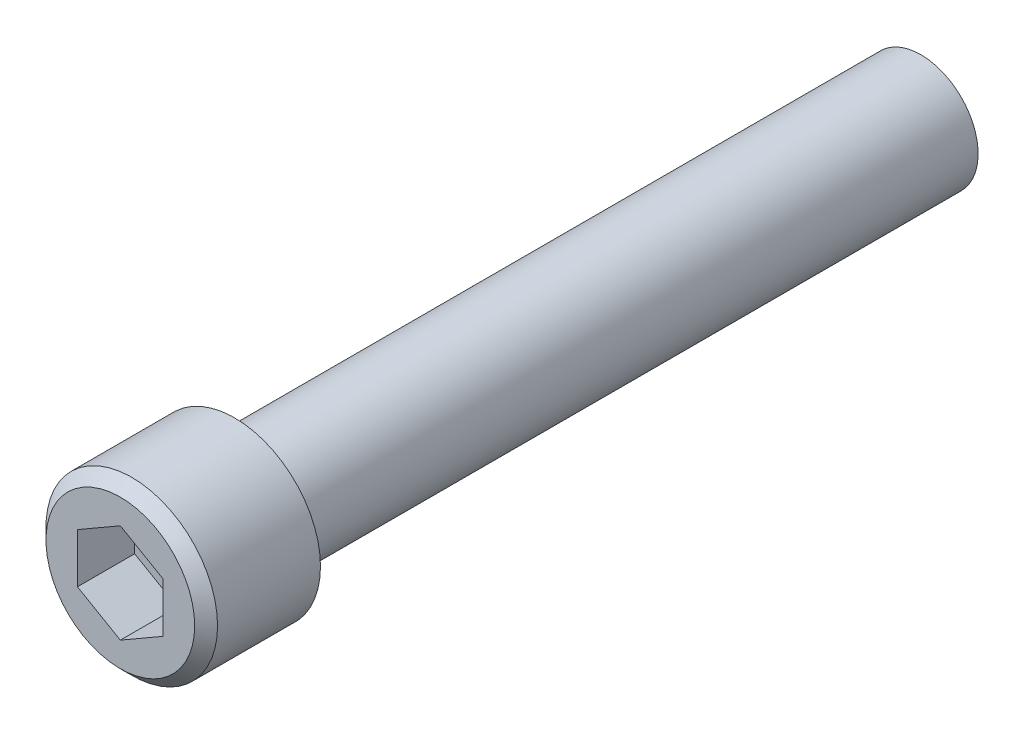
ISO-10303-21;
HEADER;
FILE_DESCRIPTION(('STEP AP214'),'2;1');
FILE_NAME('part.step','',(''),(''),'','','');
FILE_SCHEMA(('AUTOMOTIVE_DESIGN { 1 0 10303 214 1 1 1 1 }'));
ENDSEC;
DATA;
#1=APPLICATION_CONTEXT('core data for automotive mechanical design processes');
#2=APPLICATION_PROTOCOL_DEFINITION('international standard','automotive_design',2000,#1);
#3=PRODUCT_CONTEXT('',#1,'mechanical');
#4=PRODUCT('Part','Part','',(#3));
#5=PRODUCT_RELATED_PRODUCT_CATEGORY('part','',(#4));
#6=PRODUCT_DEFINITION_FORMATION('','',#4);
#7=PRODUCT_DEFINITION_CONTEXT('part definition',#1,'design');
#8=PRODUCT_DEFINITION('design','',#6,#7);
#9=PRODUCT_DEFINITION_SHAPE('','',#8);
#10=(LENGTH_UNIT() NAMED_UNIT(*) SI_UNIT(.MILLI.,.METRE.));
#11=(NAMED_UNIT(*) PLANE_ANGLE_UNIT() SI_UNIT($,.RADIAN.));
#12=(NAMED_UNIT(*) SI_UNIT($,.STERADIAN.) SOLID_ANGLE_UNIT());
#13=UNCERTAINTY_MEASURE_WITH_UNIT(LENGTH_MEASURE(1.E-05),#10,'distance_accuracy_value','');
#14=(GEOMETRIC_REPRESENTATION_CONTEXT(3) GLOBAL_UNCERTAINTY_ASSIGNED_CONTEXT((#13)) GLOBAL_UNIT_ASSIGNED_CONTEXT((#10,
#11,#12)) REPRESENTATION_CONTEXT('',''));
#15=CARTESIAN_POINT('',(0.,0.,0.));
#16=DIRECTION('',(0.,0.,1.));
#17=DIRECTION('',(1.,0.,0.));
#18=AXIS2_PLACEMENT_3D('',#15,#16,#17);
#19=CARTESIAN_POINT('',(0.,0.,38.1));
#20=DIRECTION('',(0.,0.,-1.));
#21=DIRECTION('',(-1.,0.,0.));
#22=AXIS2_PLACEMENT_3D('',#19,#20,#21);
#23=CYLINDRICAL_SURFACE('',#22,3.175);
#24=CARTESIAN_POINT('',(0.,0.,37.7444));
#25=DIRECTION('',(0.,0.,1.));
#26=DIRECTION('',(1.,0.,0.));
#27=AXIS2_PLACEMENT_3D('',#24,#25,#26);
#28=CIRCLE('',#27,3.175);
#29=CARTESIAN_POINT('',(-3.175,0.,37.7444));
#30=VERTEX_POINT('',#29);
#31=EDGE_CURVE('E147',#30,#30,#28,.F.);
#32=CARTESIAN_POINT('',(0.,0.,0.));
#33=DIRECTION('',(0.,0.,1.));
#34=DIRECTION('',(1.,0.,0.));
#35=AXIS2_PLACEMENT_3D('',#32,#33,#34);
#36=CIRCLE('',#35,3.175);
#37=CARTESIAN_POINT('',(-3.175,0.,0.));
#38=VERTEX_POINT('',#37);
#39=EDGE_CURVE('E141',#38,#38,#36,.T.);
#40=CARTESIAN_POINT('',(-3.175,0.,37.7444));
#41=CARTESIAN_POINT('',(-3.175,0.,37.3512291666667));
#42=CARTESIAN_POINT('',(-3.175,0.,36.9580583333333));
#43=CARTESIAN_POINT('',(-3.175,0.,36.1717166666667));
#44=CARTESIAN_POINT('',(-3.175,0.,35.7785458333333));
#45=CARTESIAN_POINT('',(-3.175,0.,34.9922041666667));
#46=CARTESIAN_POINT('',(-3.175,0.,34.5990333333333));
#47=CARTESIAN_POINT('',(-3.175,0.,33.8126916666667));
#48=CARTESIAN_POINT('',(-3.175,0.,33.4195208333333));
#49=CARTESIAN_POINT('',(-3.175,0.,32.6331791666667));
#50=CARTESIAN_POINT('',(-3.175,0.,32.2400083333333));
#51=CARTESIAN_POINT('',(-3.175,0.,31.4536666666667));
#52=CARTESIAN_POINT('',(-3.175,0.,31.0604958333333));
#53=CARTESIAN_POINT('',(-3.175,0.,30.2741541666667));
#54=CARTESIAN_POINT('',(-3.175,0.,29.8809833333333));
#55=CARTESIAN_POINT('',(-3.175,0.,29.0946416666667));
#56=CARTESIAN_POINT('',(-3.175,0.,28.7014708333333));
#57=CARTESIAN_POINT('',(-3.175,0.,27.9151291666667));
#58=CARTESIAN_POINT('',(-3.175,0.,27.5219583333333));
#59=CARTESIAN_POINT('',(-3.175,0.,26.7356166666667));
#60=CARTESIAN_POINT('',(-3.175,0.,26.3424458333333));
#61=CARTESIAN_POINT('',(-3.175,0.,25.5561041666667));
#62=CARTESIAN_POINT('',(-3.175,0.,25.1629333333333));
#63=CARTESIAN_POINT('',(-3.175,0.,24.3765916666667));
#64=CARTESIAN_POINT('',(-3.175,0.,23.9834208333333));
#65=CARTESIAN_POINT('',(-3.175,0.,23.1970791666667));
#66=CARTESIAN_POINT('',(-3.175,0.,22.8039083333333));
#67=CARTESIAN_POINT('',(-3.175,0.,22.0175666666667));
#68=CARTESIAN_POINT('',(-3.175,0.,21.6243958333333));
#69=CARTESIAN_POINT('',(-3.175,0.,20.8380541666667));
#70=CARTESIAN_POINT('',(-3.175,0.,20.4448833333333));
#71=CARTESIAN_POINT('',(-3.175,0.,19.6585416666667));
#72=CARTESIAN_POINT('',(-3.175,0.,19.2653708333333));
#73=CARTESIAN_POINT('',(-3.175,0.,18.4790291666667));
#74=CARTESIAN_POINT('',(-3.175,0.,18.0858583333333));
#75=CARTESIAN_POINT('',(-3.175,0.,17.2995166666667));
#76=CARTESIAN_POINT('',(-3.175,0.,16.9063458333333));
#77=CARTESIAN_POINT('',(-3.175,0.,16.1200041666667));
#78=CARTESIAN_POINT('',(-3.175,0.,15.7268333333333));
#79=CARTESIAN_POINT('',(-3.175,0.,14.9404916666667));
#80=CARTESIAN_POINT('',(-3.175,0.,14.5473208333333));
#81=CARTESIAN_POINT('',(-3.175,0.,13.7609791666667));
#82=CARTESIAN_POINT('',(-3.175,0.,13.3678083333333));
#83=CARTESIAN_POINT('',(-3.175,0.,12.5814666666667));
#84=CARTESIAN_POINT('',(-3.175,0.,12.1882958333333));
#85=CARTESIAN_POINT('',(-3.175,0.,11.4019541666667));
#86=CARTESIAN_POINT('',(-3.175,0.,11.0087833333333));
#87=CARTESIAN_POINT('',(-3.175,0.,10.2224416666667));
#88=CARTESIAN_POINT('',(-3.175,0.,9.82927083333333));
#89=CARTESIAN_POINT('',(-3.175,0.,9.04292916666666));
#90=CARTESIAN_POINT('',(-3.175,0.,8.64975833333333));
#91=CARTESIAN_POINT('',(-3.175,0.,7.86341666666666));
#92=CARTESIAN_POINT('',(-3.175,0.,7.47024583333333));
#93=CARTESIAN_POINT('',(-3.175,0.,6.68390416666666));
#94=CARTESIAN_POINT('',(-3.175,0.,6.29073333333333));
#95=CARTESIAN_POINT('',(-3.175,0.,5.50439166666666));
#96=CARTESIAN_POINT('',(-3.175,0.,5.11122083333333));
#97=CARTESIAN_POINT('',(-3.175,0.,4.32487916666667));
#98=CARTESIAN_POINT('',(-3.175,0.,3.93170833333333));
#99=CARTESIAN_POINT('',(-3.175,0.,3.14536666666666));
#100=CARTESIAN_POINT('',(-3.175,0.,2.75219583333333));
#101=CARTESIAN_POINT('',(-3.175,0.,1.96585416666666));
#102=CARTESIAN_POINT('',(-3.175,0.,1.57268333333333));
#103=CARTESIAN_POINT('',(-3.175,0.,0.786341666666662));
#104=CARTESIAN_POINT('',(-3.175,0.,0.393170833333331));
#105=CARTESIAN_POINT('',(-3.175,0.,0.));
#106=B_SPLINE_CURVE_WITH_KNOTS('',3,(#40,#41,#42,#43,#44,#45,#46,#47,#48,#49,#50,#51,#52,#53,
#54,#55,#56,#57,#58,#59,#60,#61,#62,#63,#64,#65,#66,#67,#68,#69,#70,#71,#72,#73,#74,#75,#76,#77,
#78,#79,#80,#81,#82,#83,#84,#85,#86,#87,#88,#89,#90,#91,#92,#93,#94,#95,#96,#97,#98,#99,#100,
#101,#102,#103,#104,#105),.UNSPECIFIED.,.F.,.F.,(4,2,2,2,2,2,2,2,2,2,2,2,2,2,2,2,2,2,2,2,2,2,2,
2,2,2,2,2,2,2,2,2,4),(0.,1.1795125,2.359025,3.5385375,4.71805,5.8975625,7.07707500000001,
8.2565875,9.4361,10.6156125,11.795125,12.9746375,14.15415,15.3336625,16.513175,17.6926875,
18.8722,20.0517125,21.231225,22.4107375,23.59025,24.7697625,25.949275,27.1287875,28.3083,
29.4878125,30.667325,31.8468375,33.02635,34.2058625,35.385375,36.5648875,37.7444),.UNSPECIFIED.);
#107=EDGE_CURVE('BSEAM34',#30,#38,#106,.T.);
#108=ORIENTED_EDGE('',*,*,#31,.T.);
#109=ORIENTED_EDGE('',*,*,#39,.T.);
#110=ORIENTED_EDGE('',*,*,#107,.T.);
#111=ORIENTED_EDGE('',*,*,#107,.F.);
#112=EDGE_LOOP('',(#108,#110,#109,#111));
#113=FACE_BOUND('',#112,.T.);
#114=ADVANCED_FACE('F34',(#113),#23,.T.);
#115=CARTESIAN_POINT('',(0.,0.,0.));
#116=DIRECTION('',(0.,0.,1.));
#117=DIRECTION('',(1.,0.,0.));
#118=AXIS2_PLACEMENT_3D('',#115,#116,#117);
#119=PLANE('',#118);
#120=ORIENTED_EDGE('',*,*,#39,.F.);
#121=EDGE_LOOP('',(#120));
#122=FACE_BOUND('',#121,.T.);
#123=ADVANCED_FACE('F165',(#122),#119,.F.);
#124=CARTESIAN_POINT('',(0.,0.,38.1));
#125=DIRECTION('',(0.,0.,1.));
#126=DIRECTION('',(1.,0.,0.));
#127=AXIS2_PLACEMENT_3D('',#124,#125,#126);
#128=PLANE('',#127);
#129=CARTESIAN_POINT('',(0.,0.,38.1));
#130=DIRECTION('',(0.,0.,1.));
#131=DIRECTION('',(1.,0.,0.));
#132=AXIS2_PLACEMENT_3D('',#129,#130,#131);
#133=CIRCLE('',#132,3.5306);
#134=CARTESIAN_POINT('',(3.5306,0.,38.1));
#135=VERTEX_POINT('',#134);
#136=EDGE_CURVE('E144',#135,#135,#133,.T.);
#137=ORIENTED_EDGE('',*,*,#136,.T.);
#138=EDGE_LOOP('',(#137));
#139=FACE_BOUND('',#138,.T.);
#140=CARTESIAN_POINT('',(0.,0.,38.1));
#141=DIRECTION('',(0.,0.,1.));
#142=DIRECTION('',(1.,0.,0.));
#143=AXIS2_PLACEMENT_3D('',#140,#141,#142);
#144=CIRCLE('',#143,4.7625);
#145=CARTESIAN_POINT('',(4.7625,0.,38.1));
#146=VERTEX_POINT('',#145);
#147=EDGE_CURVE('E132',#146,#146,#144,.T.);
#148=ORIENTED_EDGE('',*,*,#147,.F.);
#149=EDGE_LOOP('',(#148));
#150=FACE_BOUND('',#149,.T.);
#151=ADVANCED_FACE('F170',(#139,#150),#128,.F.);
#152=CARTESIAN_POINT('',(0.,0.,44.45));
#153=DIRECTION('',(0.,0.,-1.));
#154=DIRECTION('',(-1.,0.,0.));
#155=AXIS2_PLACEMENT_3D('',#152,#153,#154);
#156=CYLINDRICAL_SURFACE('',#155,4.7625);
#157=CARTESIAN_POINT('',(0.,0.,43.815));
#158=DIRECTION('',(0.,0.,1.));
#159=DIRECTION('',(1.,0.,0.));
#160=AXIS2_PLACEMENT_3D('',#157,#158,#159);
#161=CIRCLE('',#160,4.7625);
#162=CARTESIAN_POINT('',(4.7625,0.,43.815));
#163=VERTEX_POINT('',#162);
#164=EDGE_CURVE('E11',#163,#163,#161,.F.);
#165=ORIENTED_EDGE('',*,*,#164,.T.);
#166=EDGE_LOOP('',(#165));
#167=FACE_BOUND('',#166,.T.);
#168=ORIENTED_EDGE('',*,*,#147,.T.);
#169=EDGE_LOOP('',(#168));
#170=FACE_BOUND('',#169,.T.);
#171=ADVANCED_FACE('F185',(#167,#170),#156,.T.);
#172=CARTESIAN_POINT('',(0.,0.,44.45));
#173=DIRECTION('',(0.,0.,1.));
#174=DIRECTION('',(1.,0.,0.));
#175=AXIS2_PLACEMENT_3D('',#172,#173,#174);
#176=PLANE('',#175);
#177=CARTESIAN_POINT('',(0.,0.,44.45));
#178=DIRECTION('',(0.,0.,1.));
#179=DIRECTION('',(1.,0.,0.));
#180=AXIS2_PLACEMENT_3D('',#177,#178,#179);
#181=CIRCLE('',#180,4.12749999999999);
#182=CARTESIAN_POINT('',(4.12749999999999,0.,44.45));
#183=VERTEX_POINT('',#182);
#184=EDGE_CURVE('E41',#183,#183,#181,.T.);
#185=ORIENTED_EDGE('',*,*,#184,.T.);
#186=EDGE_LOOP('',(#185));
#187=FACE_BOUND('',#186,.T.);
#188=DIRECTION('',(-0.866025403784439,-0.5,0.));
#189=VECTOR('',#188,1.);
#190=CARTESIAN_POINT('',(0.,2.74963065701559,44.4500000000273));
#191=LINE('',#190,#189);
#192=CARTESIAN_POINT('',(0.,2.74963065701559,44.4500000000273));
#193=VERTEX_POINT('',#192);
#194=CARTESIAN_POINT('',(-2.38125,1.3748153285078,44.45));
#195=VERTEX_POINT('',#194);
#196=EDGE_CURVE('E48',#193,#195,#191,.T.);
#197=ORIENTED_EDGE('',*,*,#196,.F.);
#198=DIRECTION('',(0.866025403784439,-0.5,0.));
#199=VECTOR('',#198,1.);
#200=CARTESIAN_POINT('',(0.,2.74963065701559,44.4500000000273));
#201=LINE('',#200,#199);
#202=CARTESIAN_POINT('',(2.38125,1.3748153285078,44.4500000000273));
#203=VERTEX_POINT('',#202);
#204=EDGE_CURVE('E115',#193,#203,#201,.T.);
#205=ORIENTED_EDGE('',*,*,#204,.T.);
#206=DIRECTION('',(0.,-1.,0.));
#207=VECTOR('',#206,1.);
#208=CARTESIAN_POINT('',(2.38125,1.3748153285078,44.4500000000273));
#209=LINE('',#208,#207);
#210=CARTESIAN_POINT('',(2.38125,-1.3748153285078,44.4500000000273));
#211=VERTEX_POINT('',#210);
#212=EDGE_CURVE('E110',#203,#211,#209,.T.);
#213=ORIENTED_EDGE('',*,*,#212,.T.);
#214=DIRECTION('',(0.86602540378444,0.499999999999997,0.));
#215=VECTOR('',#214,1.);
#216=CARTESIAN_POINT('',(0.,-2.74963065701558,44.4500000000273));
#217=LINE('',#216,#215);
#218=CARTESIAN_POINT('',(0.,-2.74963065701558,44.4500000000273));
#219=VERTEX_POINT('',#218);
#220=EDGE_CURVE('E108',#219,#211,#217,.T.);
#221=ORIENTED_EDGE('',*,*,#220,.F.);
#222=DIRECTION('',(-0.86602540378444,0.499999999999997,0.));
#223=VECTOR('',#222,1.);
#224=CARTESIAN_POINT('',(0.,-2.74963065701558,44.4500000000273));
#225=LINE('',#224,#223);
#226=CARTESIAN_POINT('',(-2.38125,-1.3748153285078,44.4500000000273));
#227=VERTEX_POINT('',#226);
#228=EDGE_CURVE('E90',#219,#227,#225,.T.);
#229=ORIENTED_EDGE('',*,*,#228,.T.);
#230=DIRECTION('',(0.,-1.,0.));
#231=VECTOR('',#230,1.);
#232=CARTESIAN_POINT('',(-2.38125,1.3748153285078,44.4500000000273));
#233=LINE('',#232,#231);
#234=EDGE_CURVE('E101',#195,#227,#233,.T.);
#235=ORIENTED_EDGE('',*,*,#234,.F.);
#236=EDGE_LOOP('',(#197,#205,#213,#221,#229,#235));
#237=FACE_BOUND('',#236,.T.);
#238=ADVANCED_FACE('F105',(#187,#237),#176,.T.);
#239=CARTESIAN_POINT('',(0.,0.,37.7444));
#240=DIRECTION('',(0.,0.,1.));
#241=DIRECTION('',(1.,0.,0.));
#242=AXIS2_PLACEMENT_3D('',#239,#240,#241);
#243=TOROIDAL_SURFACE('',#242,3.5306,0.3556);
#244=ORIENTED_EDGE('',*,*,#31,.F.);
#245=EDGE_LOOP('',(#244));
#246=FACE_BOUND('',#245,.T.);
#247=ORIENTED_EDGE('',*,*,#136,.F.);
#248=EDGE_LOOP('',(#247));
#249=FACE_BOUND('',#248,.T.);
#250=ADVANCED_FACE('F176',(#246,#249),#243,.F.);
#251=CARTESIAN_POINT('',(0.,2.74963065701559,41.2750000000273));
#252=DIRECTION('',(-0.5,0.866025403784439,0.));
#253=DIRECTION('',(-0.866025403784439,-0.5,0.));
#254=AXIS2_PLACEMENT_3D('',#251,#252,#253);
#255=PLANE('',#254);
#256=ORIENTED_EDGE('',*,*,#196,.T.);
#257=DIRECTION('',(0.,0.,1.));
#258=VECTOR('',#257,1.);
#259=CARTESIAN_POINT('',(-2.38125,1.3748153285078,41.2750000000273));
#260=LINE('',#259,#258);
#261=CARTESIAN_POINT('',(-2.38125,1.3748153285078,41.2750000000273));
#262=VERTEX_POINT('',#261);
#263=EDGE_CURVE('E98',#262,#195,#260,.T.);
#264=ORIENTED_EDGE('',*,*,#263,.F.);
#265=DIRECTION('',(-0.866025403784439,-0.5,0.));
#266=VECTOR('',#265,1.);
#267=CARTESIAN_POINT('',(0.,2.74963065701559,41.2750000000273));
#268=LINE('',#267,#266);
#269=CARTESIAN_POINT('',(0.,2.74963065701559,41.2750000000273));
#270=VERTEX_POINT('',#269);
#271=EDGE_CURVE('E118',#270,#262,#268,.T.);
#272=ORIENTED_EDGE('',*,*,#271,.F.);
#273=DIRECTION('',(0.,0.,1.));
#274=VECTOR('',#273,1.);
#275=CARTESIAN_POINT('',(0.,2.74963065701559,41.2750000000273));
#276=LINE('',#275,#274);
#277=EDGE_CURVE('E55',#270,#193,#276,.T.);
#278=ORIENTED_EDGE('',*,*,#277,.T.);
#279=EDGE_LOOP('',(#256,#264,#272,#278));
#280=FACE_BOUND('',#279,.T.);
#281=ADVANCED_FACE('F179',(#280),#255,.F.);
#282=CARTESIAN_POINT('',(0.,2.74963065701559,41.2750000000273));
#283=DIRECTION('',(-0.5,-0.866025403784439,0.));
#284=DIRECTION('',(0.866025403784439,-0.5,0.));
#285=AXIS2_PLACEMENT_3D('',#282,#283,#284);
#286=PLANE('',#285);
#287=ORIENTED_EDGE('',*,*,#204,.F.);
#288=ORIENTED_EDGE('',*,*,#277,.F.);
#289=DIRECTION('',(0.866025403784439,-0.5,0.));
#290=VECTOR('',#289,1.);
#291=CARTESIAN_POINT('',(0.,2.74963065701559,41.2750000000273));
#292=LINE('',#291,#290);
#293=CARTESIAN_POINT('',(2.38125,1.3748153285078,41.2750000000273));
#294=VERTEX_POINT('',#293);
#295=EDGE_CURVE('E129',#270,#294,#292,.T.);
#296=ORIENTED_EDGE('',*,*,#295,.T.);
#297=DIRECTION('',(0.,0.,1.));
#298=VECTOR('',#297,1.);
#299=CARTESIAN_POINT('',(2.38125,1.3748153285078,41.2750000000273));
#300=LINE('',#299,#298);
#301=EDGE_CURVE('E133',#294,#203,#300,.T.);
#302=ORIENTED_EDGE('',*,*,#301,.T.);
#303=EDGE_LOOP('',(#287,#288,#296,#302));
#304=FACE_BOUND('',#303,.T.);
#305=ADVANCED_FACE('F199',(#304),#286,.T.);
#306=CARTESIAN_POINT('',(2.38125,1.3748153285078,41.2750000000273));
#307=DIRECTION('',(-1.,0.,0.));
#308=DIRECTION('',(0.,0.,1.));
#309=AXIS2_PLACEMENT_3D('',#306,#307,#308);
#310=PLANE('',#309);
#311=ORIENTED_EDGE('',*,*,#212,.F.);
#312=ORIENTED_EDGE('',*,*,#301,.F.);
#313=DIRECTION('',(0.,-1.,0.));
#314=VECTOR('',#313,1.);
#315=CARTESIAN_POINT('',(2.38125,1.3748153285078,41.2750000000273));
#316=LINE('',#315,#314);
#317=CARTESIAN_POINT('',(2.38125,-1.3748153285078,41.2750000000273));
#318=VERTEX_POINT('',#317);
#319=EDGE_CURVE('E127',#294,#318,#316,.T.);
#320=ORIENTED_EDGE('',*,*,#319,.T.);
#321=DIRECTION('',(0.,0.,1.));
#322=VECTOR('',#321,1.);
#323=CARTESIAN_POINT('',(2.38125,-1.3748153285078,41.2750000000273));
#324=LINE('',#323,#322);
#325=EDGE_CURVE('E135',#318,#211,#324,.T.);
#326=ORIENTED_EDGE('',*,*,#325,.T.);
#327=EDGE_LOOP('',(#311,#312,#320,#326));
#328=FACE_BOUND('',#327,.T.);
#329=ADVANCED_FACE('F207',(#328),#310,.T.);
#330=CARTESIAN_POINT('',(0.,-2.74963065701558,41.2750000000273));
#331=DIRECTION('',(0.499999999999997,-0.86602540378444,0.));
#332=DIRECTION('',(0.86602540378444,0.499999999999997,0.));
#333=AXIS2_PLACEMENT_3D('',#330,#331,#332);
#334=PLANE('',#333);
#335=ORIENTED_EDGE('',*,*,#220,.T.);
#336=ORIENTED_EDGE('',*,*,#325,.F.);
#337=DIRECTION('',(0.86602540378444,0.499999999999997,0.));
#338=VECTOR('',#337,1.);
#339=CARTESIAN_POINT('',(0.,-2.74963065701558,41.2750000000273));
#340=LINE('',#339,#338);
#341=CARTESIAN_POINT('',(0.,-2.74963065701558,41.2750000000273));
#342=VERTEX_POINT('',#341);
#343=EDGE_CURVE('E124',#342,#318,#340,.T.);
#344=ORIENTED_EDGE('',*,*,#343,.F.);
#345=DIRECTION('',(0.,0.,1.));
#346=VECTOR('',#345,1.);
#347=CARTESIAN_POINT('',(0.,-2.74963065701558,41.2750000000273));
#348=LINE('',#347,#346);
#349=EDGE_CURVE('E97',#342,#219,#348,.T.);
#350=ORIENTED_EDGE('',*,*,#349,.T.);
#351=EDGE_LOOP('',(#335,#336,#344,#350));
#352=FACE_BOUND('',#351,.T.);
#353=ADVANCED_FACE('F204',(#352),#334,.F.);
#354=CARTESIAN_POINT('',(0.,-2.74963065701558,41.2750000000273));
#355=DIRECTION('',(0.499999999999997,0.86602540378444,0.));
#356=DIRECTION('',(-0.86602540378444,0.499999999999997,0.));
#357=AXIS2_PLACEMENT_3D('',#354,#355,#356);
#358=PLANE('',#357);
#359=ORIENTED_EDGE('',*,*,#228,.F.);
#360=ORIENTED_EDGE('',*,*,#349,.F.);
#361=DIRECTION('',(-0.86602540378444,0.499999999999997,0.));
#362=VECTOR('',#361,1.);
#363=CARTESIAN_POINT('',(0.,-2.74963065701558,41.2750000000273));
#364=LINE('',#363,#362);
#365=CARTESIAN_POINT('',(-2.38125,-1.3748153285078,41.2750000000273));
#366=VERTEX_POINT('',#365);
#367=EDGE_CURVE('E93',#342,#366,#364,.T.);
#368=ORIENTED_EDGE('',*,*,#367,.T.);
#369=DIRECTION('',(0.,0.,1.));
#370=VECTOR('',#369,1.);
#371=CARTESIAN_POINT('',(-2.38125,-1.3748153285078,41.2750000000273));
#372=LINE('',#371,#370);
#373=EDGE_CURVE('E86',#366,#227,#372,.T.);
#374=ORIENTED_EDGE('',*,*,#373,.T.);
#375=EDGE_LOOP('',(#359,#360,#368,#374));
#376=FACE_BOUND('',#375,.T.);
#377=ADVANCED_FACE('F88',(#376),#358,.T.);
#378=CARTESIAN_POINT('',(-2.38125,1.3748153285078,41.2750000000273));
#379=DIRECTION('',(-1.,0.,0.));
#380=DIRECTION('',(0.,0.,1.));
#381=AXIS2_PLACEMENT_3D('',#378,#379,#380);
#382=PLANE('',#381);
#383=ORIENTED_EDGE('',*,*,#234,.T.);
#384=ORIENTED_EDGE('',*,*,#373,.F.);
#385=DIRECTION('',(0.,-1.,0.));
#386=VECTOR('',#385,1.);
#387=CARTESIAN_POINT('',(-2.38125,1.3748153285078,41.2750000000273));
#388=LINE('',#387,#386);
#389=EDGE_CURVE('E121',#262,#366,#388,.T.);
#390=ORIENTED_EDGE('',*,*,#389,.F.);
#391=ORIENTED_EDGE('',*,*,#263,.T.);
#392=EDGE_LOOP('',(#383,#384,#390,#391));
#393=FACE_BOUND('',#392,.T.);
#394=ADVANCED_FACE('F102',(#393),#382,.F.);
#395=CARTESIAN_POINT('',(-2.38125,1.3748153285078,41.2750000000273));
#396=DIRECTION('',(0.,0.,1.));
#397=DIRECTION('',(1.,0.,0.));
#398=AXIS2_PLACEMENT_3D('',#395,#396,#397);
#399=PLANE('',#398);
#400=ORIENTED_EDGE('',*,*,#271,.T.);
#401=ORIENTED_EDGE('',*,*,#389,.T.);
#402=ORIENTED_EDGE('',*,*,#367,.F.);
#403=ORIENTED_EDGE('',*,*,#343,.T.);
#404=ORIENTED_EDGE('',*,*,#319,.F.);
#405=ORIENTED_EDGE('',*,*,#295,.F.);
#406=EDGE_LOOP('',(#400,#401,#402,#403,#404,#405));
#407=FACE_BOUND('',#406,.T.);
#408=ADVANCED_FACE('F155',(#407),#399,.T.);
#409=CARTESIAN_POINT('',(0.,0.,44.45));
#410=DIRECTION('',(0.,0.,-1.));
#411=DIRECTION('',(-1.,0.,0.));
#412=AXIS2_PLACEMENT_3D('',#409,#410,#411);
#413=CONICAL_SURFACE('',#412,4.12749999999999,0.785398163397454);
#414=ORIENTED_EDGE('',*,*,#164,.F.);
#415=EDGE_LOOP('',(#414));
#416=FACE_BOUND('',#415,.T.);
#417=ORIENTED_EDGE('',*,*,#184,.F.);
#418=EDGE_LOOP('',(#417));
#419=FACE_BOUND('',#418,.T.);
#420=ADVANCED_FACE('F153',(#416,#419),#413,.T.);
#421=CLOSED_SHELL('',(#114,#123,#151,#171,#238,#250,#281,#305,#329,#353,#377,#394,#408,#420));
#422=MANIFOLD_SOLID_BREP('B2',#421);
#423=ADVANCED_BREP_SHAPE_REPRESENTATION('',(#18,#422),#14);
#424=SHAPE_DEFINITION_REPRESENTATION(#9,#423);
ENDSEC;
END-ISO-10303-21;
